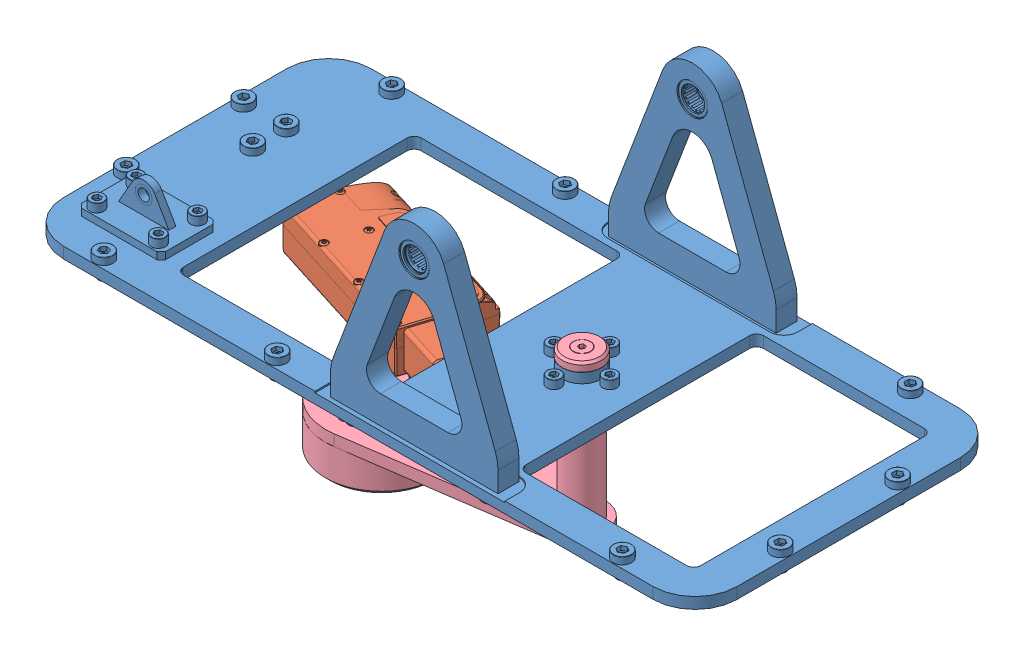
SolidWorks assembly Orientation_Surcharge_Meca3D.SLDASM, configuration Défaut (file format 12000). Lengths in mm.
Overall size (482 261 220).
4 component instances, 4 part files, 6 mates.
Components (placement in the parent):
- structure-1: structure.SLDPRT [Défaut] at (-42.7877 -69.6581 482) size (482 166.2 220)
- corps_verin-1: corps_verin.SLDPRT [Défaut] at (-148.06 -92.8081 462.1673) x (-0.300379 0 0.95382) z (-0.95382 0 -0.300379) size (61.61 33.46 185.99)
- tige_verin-1: tige_verin.SLDPRT [Défaut] at (-145.8066 -92.7581 477.1878) x (0 -1 0) z (-0.95382 0 -0.300379) size (29.4 20.4 138.61)
- surcharge-1: surcharge.SLDPRT [Défaut] at (7.2123 -161.1581 482) x (0.999938 0 0.011164) z (-0.011164 0 0.999938) size (202.5 137.75 84.47)
Mates (geometry in assembly coordinates):
- Coaxiale1: concentric anti-aligned: cylinder of structure-1 through (-225.7877 -90.3581 452) axis (0 -1 0) radius 4; cylinder of corps_verin-1 through (-225.7877 -86.2791 452) axis (0 1 0) radius 4
- Coïncidente1: coincident anti-aligned: plane of structure-1 through (-225.7877 -95.3581 452) normal (0 -1 0); plane of corps_verin-1 through (-211.5025 -95.3581 447.5872) normal (0 1 0)
- Coaxiale2: concentric aligned: cylinder of corps_verin-1 through (-69.8456 -92.7581 501.1096) axis (0.95382 0 0.300379) radius 8.5; cylinder of tige_verin-1 through (-136.2684 -92.7581 480.1916) axis (0.95382 0 0.300379) radius 8.5
- Coaxiale3: concentric anti-aligned: cylinder of structure-1 through (7.2123 -89.8581 482) axis (0 -1 0) radius 10; cylinder of surcharge-1 through (7.2123 -58.4581 482) axis (0 1 0) radius 10
- Coaxiale4: concentric anti-aligned: cylinder of tige_verin-1 through (-22.0961 -86.2791 516.1469) axis (0 1 0) radius 4; cylinder of surcharge-1 through (-22.0961 -90.1581 516.1469) axis (0 -1 0) radius 6
- Coïncidente2: coincident anti-aligned: plane of tige_verin-1 through (-22.0961 -90.1581 516.1469) normal (0 -1 0); plane of surcharge-1 through (7.2123 -90.1581 482) normal (0 1 0)
